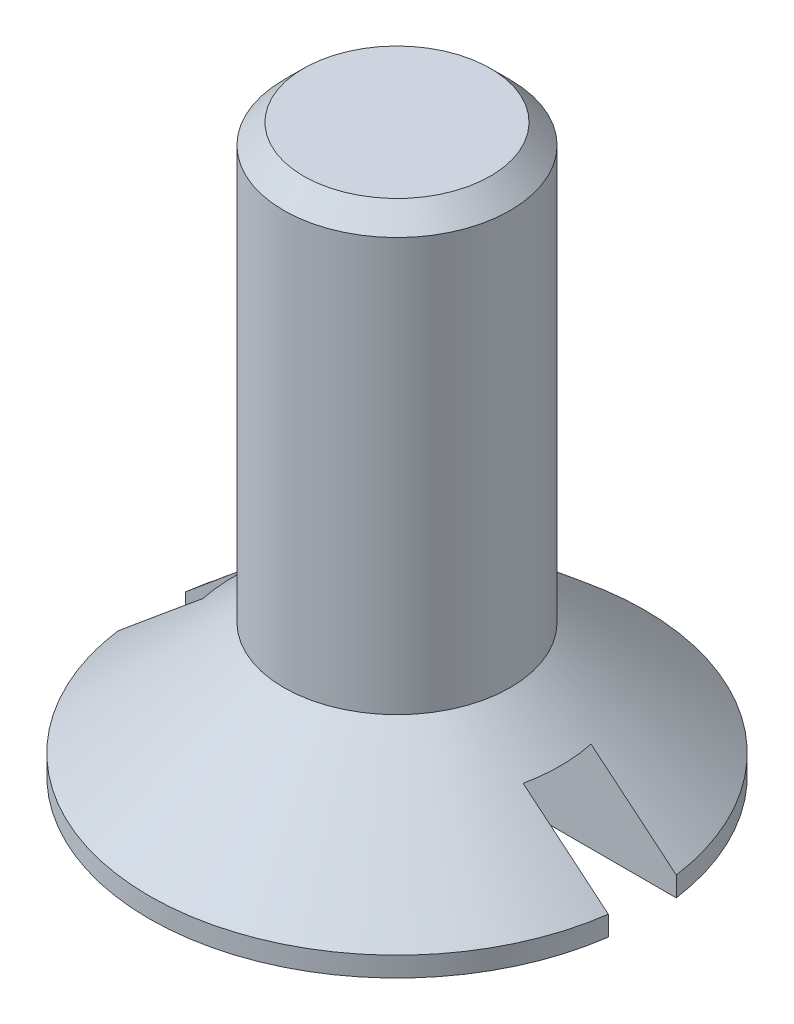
from build123d import *

# Parameters (mm, degrees)
SKETCH1_R               = 4.375
BOSS_EXTRUDE1_DEPTH     = 0.35
SKETCH5_R               = 2
BOSS_EXTRUDE3_DEPTH     = 7.65
CUT_EXTRUDE1_DEPTH      = 12.759304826
CUT_EXTRUDE1_DEPTH_BACK = 12.759304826
SKETCH6_W               = 1.2
SKETCH6_H               = 3.2
SKETCH7_OUTSIDE_W       = 33.84
SKETCH7_OUTSIDE_H       = 33.922
SKETCH7_OUTSIDE_R       = 1.65
CUT_EXTRUDE2_DEPTH      = 10
CUT_EXTRUDE2_DRAFT      = -45


with BuildPart() as part:
    # Sketch1 → Boss-Extrude1 (new body)
    with BuildSketch(Plane(origin=(0, 0, 0), x_dir=(1, 0, 0), z_dir=(0, 1, 0))):
        with Locations(Location((0, 0, 0), (0, 0, 270))):
            Circle(SKETCH1_R)
    extrude(amount=BOSS_EXTRUDE1_DEPTH)

    # Sketch4 → Revolve1 (revolve)
    with BuildSketch(Plane(origin=(0, 0, 0), x_dir=(0, 0, -1), z_dir=(1, 0, 0))):
        Polygon((-4.375, 0.35), (-2, 2.35), (0, 2.35), (0, 0.35), align=None)
    revolve(axis=Axis((0, 2.35, 0), (0, -1, 0)))

    # Sketch5 → Boss-Extrude3 (add)
    with BuildSketch(Plane(origin=(0, 2.35, 0), x_dir=(1, 0, 0), z_dir=(0, 1, 0))):
        with Locations(Location((0, 0, 0), (0, 0, 270))):
            Circle(SKETCH5_R)
    extrude(amount=BOSS_EXTRUDE3_DEPTH)

    # Sketch6 → Cut-Extrude1 (cut, two sides: drawn at the far end of the back side and taken through both)
    with BuildSketch(Plane(origin=(0, 0, 0), x_dir=(0, 0, -1), z_dir=(1, 0, 0)).offset(-CUT_EXTRUDE1_DEPTH_BACK)):
        Rectangle(SKETCH6_W, SKETCH6_H)
    extrude(amount=CUT_EXTRUDE1_DEPTH + CUT_EXTRUDE1_DEPTH_BACK, mode=Mode.SUBTRACT)


with BuildPart() as cut_extrude2_tool:
    # Sketch7 outside → Cut-Extrude2 (with draft: the straight prism first)
    with BuildSketch(Plane(origin=(0, 10, 0), x_dir=(1, 0, 0), z_dir=(0, 1, 0))):
        Rectangle(SKETCH7_OUTSIDE_W, SKETCH7_OUTSIDE_H)
        Circle(SKETCH7_OUTSIDE_R, mode=Mode.SUBTRACT)
    extrude(amount=-CUT_EXTRUDE2_DEPTH)
    # Cut-Extrude2: the draft: its side faces are tilted about the plane it starts from
    cut_extrude2_sides = [cut_extrude2_tool.faces().sort_by_distance(p)[0] for p in [
        (0, 5, 16.961),
        (16.92, 5, 0),
        (0, 5, -16.961),
        (-16.92, 5, 0),
        (-1.65, 5, 0),
    ]]
    draft(cut_extrude2_sides, Plane(origin=(0, 10, 0), x_dir=(1, 0, 0), z_dir=(0, 1, 0)), CUT_EXTRUDE2_DRAFT)


with BuildPart() as part_1:
    add(part.part)

    # Cut-Extrude2: cut by cut_extrude2_tool
    add(cut_extrude2_tool.part, mode=Mode.SUBTRACT)


solid = part_1.part
